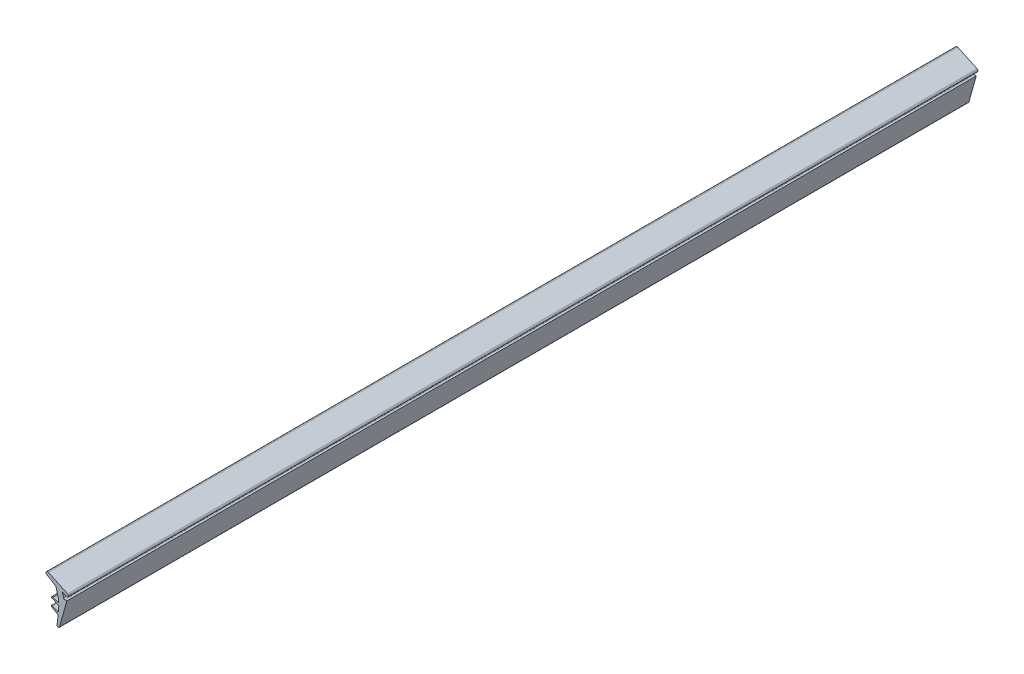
ISO-10303-21;
HEADER;
FILE_DESCRIPTION(('STEP AP214'),'2;1');
FILE_NAME('part.step','',(''),(''),'','','');
FILE_SCHEMA(('AUTOMOTIVE_DESIGN { 1 0 10303 214 1 1 1 1 }'));
ENDSEC;
DATA;
#1=APPLICATION_CONTEXT('core data for automotive mechanical design processes');
#2=APPLICATION_PROTOCOL_DEFINITION('international standard','automotive_design',2000,#1);
#3=PRODUCT_CONTEXT('',#1,'mechanical');
#4=PRODUCT('Part','Part','',(#3));
#5=PRODUCT_RELATED_PRODUCT_CATEGORY('part','',(#4));
#6=PRODUCT_DEFINITION_FORMATION('','',#4);
#7=PRODUCT_DEFINITION_CONTEXT('part definition',#1,'design');
#8=PRODUCT_DEFINITION('design','',#6,#7);
#9=PRODUCT_DEFINITION_SHAPE('','',#8);
#10=(LENGTH_UNIT() NAMED_UNIT(*) SI_UNIT(.MILLI.,.METRE.));
#11=(NAMED_UNIT(*) PLANE_ANGLE_UNIT() SI_UNIT($,.RADIAN.));
#12=(NAMED_UNIT(*) SI_UNIT($,.STERADIAN.) SOLID_ANGLE_UNIT());
#13=UNCERTAINTY_MEASURE_WITH_UNIT(LENGTH_MEASURE(1.E-05),#10,'distance_accuracy_value','');
#14=(GEOMETRIC_REPRESENTATION_CONTEXT(3) GLOBAL_UNCERTAINTY_ASSIGNED_CONTEXT((#13)) GLOBAL_UNIT_ASSIGNED_CONTEXT((#10,
#11,#12)) REPRESENTATION_CONTEXT('',''));
#15=CARTESIAN_POINT('',(0.,0.,0.));
#16=DIRECTION('',(0.,0.,1.));
#17=DIRECTION('',(1.,0.,0.));
#18=AXIS2_PLACEMENT_3D('',#15,#16,#17);
#19=CARTESIAN_POINT('',(0.211137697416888,-1.32671915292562,150.));
#20=DIRECTION('',(0.987572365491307,0.157164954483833,0.));
#21=DIRECTION('',(-0.157164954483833,0.987572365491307,0.));
#22=AXIS2_PLACEMENT_3D('',#19,#20,#21);
#23=PLANE('',#22);
#24=DIRECTION('',(0.157164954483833,-0.987572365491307,0.));
#25=VECTOR('',#24,1.);
#26=CARTESIAN_POINT('',(0.211137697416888,-1.32671915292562,-150.));
#27=LINE('',#26,#25);
#28=CARTESIAN_POINT('',(0.,0.,-150.));
#29=VERTEX_POINT('',#28);
#30=CARTESIAN_POINT('',(0.211137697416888,-1.32671915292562,-150.));
#31=VERTEX_POINT('',#30);
#32=EDGE_CURVE('E222',#29,#31,#27,.T.);
#33=ORIENTED_EDGE('',*,*,#32,.T.);
#34=DIRECTION('',(0.,0.,-1.));
#35=VECTOR('',#34,1.);
#36=CARTESIAN_POINT('',(0.211137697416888,-1.32671915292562,150.));
#37=LINE('',#36,#35);
#38=CARTESIAN_POINT('',(0.211137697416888,-1.32671915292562,150.));
#39=VERTEX_POINT('',#38);
#40=EDGE_CURVE('E203',#39,#31,#37,.T.);
#41=ORIENTED_EDGE('',*,*,#40,.F.);
#42=DIRECTION('',(0.157164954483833,-0.987572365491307,0.));
#43=VECTOR('',#42,1.);
#44=CARTESIAN_POINT('',(0.211137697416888,-1.32671915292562,150.));
#45=LINE('',#44,#43);
#46=CARTESIAN_POINT('',(0.,0.,150.));
#47=VERTEX_POINT('',#46);
#48=EDGE_CURVE('E210',#47,#39,#45,.T.);
#49=ORIENTED_EDGE('',*,*,#48,.F.);
#50=DIRECTION('',(0.,0.,-1.));
#51=VECTOR('',#50,1.);
#52=CARTESIAN_POINT('',(0.,0.,150.));
#53=LINE('',#52,#51);
#54=EDGE_CURVE('E293',#47,#29,#53,.T.);
#55=ORIENTED_EDGE('',*,*,#54,.T.);
#56=EDGE_LOOP('',(#33,#41,#49,#55));
#57=FACE_BOUND('',#56,.T.);
#58=ADVANCED_FACE('F37',(#57),#23,.F.);
#59=CARTESIAN_POINT('',(-1.72845607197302,-0.781621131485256,150.));
#60=DIRECTION('',(-0.270555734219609,-0.962704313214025,0.));
#61=DIRECTION('',(0.962704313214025,-0.270555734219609,0.));
#62=AXIS2_PLACEMENT_3D('',#59,#60,#61);
#63=PLANE('',#62);
#64=DIRECTION('',(-0.962704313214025,0.270555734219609,0.));
#65=VECTOR('',#64,1.);
#66=CARTESIAN_POINT('',(-1.72845607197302,-0.781621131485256,-150.));
#67=LINE('',#66,#65);
#68=CARTESIAN_POINT('',(-1.72845607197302,-0.781621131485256,-150.));
#69=VERTEX_POINT('',#68);
#70=EDGE_CURVE('E302',#31,#69,#67,.T.);
#71=ORIENTED_EDGE('',*,*,#70,.T.);
#72=DIRECTION('',(0.,0.,-1.));
#73=VECTOR('',#72,1.);
#74=CARTESIAN_POINT('',(-1.72845607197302,-0.781621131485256,150.));
#75=LINE('',#74,#73);
#76=CARTESIAN_POINT('',(-1.72845607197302,-0.781621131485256,150.));
#77=VERTEX_POINT('',#76);
#78=EDGE_CURVE('E206',#77,#69,#75,.T.);
#79=ORIENTED_EDGE('',*,*,#78,.F.);
#80=DIRECTION('',(-0.962704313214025,0.270555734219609,0.));
#81=VECTOR('',#80,1.);
#82=CARTESIAN_POINT('',(-1.72845607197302,-0.781621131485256,150.));
#83=LINE('',#82,#81);
#84=EDGE_CURVE('E199',#39,#77,#83,.T.);
#85=ORIENTED_EDGE('',*,*,#84,.F.);
#86=ORIENTED_EDGE('',*,*,#40,.T.);
#87=EDGE_LOOP('',(#71,#79,#85,#86));
#88=FACE_BOUND('',#87,.T.);
#89=ADVANCED_FACE('F201',(#88),#63,.F.);
#90=CARTESIAN_POINT('',(-1.94417640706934,-0.920161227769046,150.));
#91=DIRECTION('',(0.,0.,-1.));
#92=DIRECTION('',(-1.,0.,0.));
#93=AXIS2_PLACEMENT_3D('',#90,#91,#92);
#94=CYLINDRICAL_SURFACE('',#93,0.256375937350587);
#95=CARTESIAN_POINT('',(-1.94417640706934,-0.920161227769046,-150.));
#96=DIRECTION('',(0.,0.,1.));
#97=DIRECTION('',(-1.,0.,0.));
#98=AXIS2_PLACEMENT_3D('',#95,#96,#97);
#99=CIRCLE('',#98,0.256375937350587);
#100=CARTESIAN_POINT('',(-2.05178502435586,-1.15286061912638,-150.));
#101=VERTEX_POINT('',#100);
#102=EDGE_CURVE('E304',#69,#101,#99,.T.);
#103=ORIENTED_EDGE('',*,*,#102,.T.);
#104=DIRECTION('',(0.,0.,-1.));
#105=VECTOR('',#104,1.);
#106=CARTESIAN_POINT('',(-2.05178502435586,-1.15286061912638,150.));
#107=LINE('',#106,#105);
#108=CARTESIAN_POINT('',(-2.05178502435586,-1.15286061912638,150.));
#109=VERTEX_POINT('',#108);
#110=EDGE_CURVE('E227',#109,#101,#107,.T.);
#111=ORIENTED_EDGE('',*,*,#110,.F.);
#112=CARTESIAN_POINT('',(-1.94417640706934,-0.920161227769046,150.));
#113=DIRECTION('',(0.,0.,1.));
#114=DIRECTION('',(-1.,0.,0.));
#115=AXIS2_PLACEMENT_3D('',#112,#113,#114);
#116=CIRCLE('',#115,0.256375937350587);
#117=EDGE_CURVE('E209',#77,#109,#116,.T.);
#118=ORIENTED_EDGE('',*,*,#117,.F.);
#119=ORIENTED_EDGE('',*,*,#78,.T.);
#120=EDGE_LOOP('',(#103,#111,#118,#119));
#121=FACE_BOUND('',#120,.T.);
#122=ADVANCED_FACE('F483',(#121),#94,.T.);
#123=CARTESIAN_POINT('',(0.211137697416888,-2.19931795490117,150.));
#124=DIRECTION('',(0.419729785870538,0.907649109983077,0.));
#125=DIRECTION('',(-0.907649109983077,0.419729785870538,0.));
#126=AXIS2_PLACEMENT_3D('',#123,#124,#125);
#127=PLANE('',#126);
#128=DIRECTION('',(0.907649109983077,-0.419729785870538,0.));
#129=VECTOR('',#128,1.);
#130=CARTESIAN_POINT('',(0.211137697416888,-2.19931795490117,-150.));
#131=LINE('',#130,#129);
#132=CARTESIAN_POINT('',(0.211137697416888,-2.19931795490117,-150.));
#133=VERTEX_POINT('',#132);
#134=EDGE_CURVE('E306',#101,#133,#131,.T.);
#135=ORIENTED_EDGE('',*,*,#134,.T.);
#136=DIRECTION('',(0.,0.,-1.));
#137=VECTOR('',#136,1.);
#138=CARTESIAN_POINT('',(0.211137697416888,-2.19931795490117,150.));
#139=LINE('',#138,#137);
#140=CARTESIAN_POINT('',(0.211137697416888,-2.19931795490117,150.));
#141=VERTEX_POINT('',#140);
#142=EDGE_CURVE('E358',#141,#133,#139,.T.);
#143=ORIENTED_EDGE('',*,*,#142,.F.);
#144=DIRECTION('',(0.907649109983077,-0.419729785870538,0.));
#145=VECTOR('',#144,1.);
#146=CARTESIAN_POINT('',(0.211137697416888,-2.19931795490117,150.));
#147=LINE('',#146,#145);
#148=EDGE_CURVE('E367',#109,#141,#147,.T.);
#149=ORIENTED_EDGE('',*,*,#148,.F.);
#150=ORIENTED_EDGE('',*,*,#110,.T.);
#151=EDGE_LOOP('',(#135,#143,#149,#150));
#152=FACE_BOUND('',#151,.T.);
#153=ADVANCED_FACE('F365',(#152),#127,.F.);
#154=CARTESIAN_POINT('',(0.00638670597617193,-4.16746293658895,150.));
#155=DIRECTION('',(0.994632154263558,-0.103474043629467,0.));
#156=DIRECTION('',(0.103474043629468,0.994632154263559,0.));
#157=AXIS2_PLACEMENT_3D('',#154,#155,#156);
#158=PLANE('',#157);
#159=DIRECTION('',(-0.103474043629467,-0.994632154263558,0.));
#160=VECTOR('',#159,1.);
#161=CARTESIAN_POINT('',(0.00638670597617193,-4.16746293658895,-150.));
#162=LINE('',#161,#160);
#163=CARTESIAN_POINT('',(0.00638670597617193,-4.16746293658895,-150.));
#164=VERTEX_POINT('',#163);
#165=EDGE_CURVE('E308',#133,#164,#162,.T.);
#166=ORIENTED_EDGE('',*,*,#165,.T.);
#167=DIRECTION('',(0.,0.,-1.));
#168=VECTOR('',#167,1.);
#169=CARTESIAN_POINT('',(0.00638670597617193,-4.16746293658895,150.));
#170=LINE('',#169,#168);
#171=CARTESIAN_POINT('',(0.00638670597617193,-4.16746293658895,150.));
#172=VERTEX_POINT('',#171);
#173=EDGE_CURVE('E355',#172,#164,#170,.T.);
#174=ORIENTED_EDGE('',*,*,#173,.F.);
#175=DIRECTION('',(-0.103474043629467,-0.994632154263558,0.));
#176=VECTOR('',#175,1.);
#177=CARTESIAN_POINT('',(0.00638670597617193,-4.16746293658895,150.));
#178=LINE('',#177,#176);
#179=EDGE_CURVE('E384',#141,#172,#178,.T.);
#180=ORIENTED_EDGE('',*,*,#179,.F.);
#181=ORIENTED_EDGE('',*,*,#142,.T.);
#182=EDGE_LOOP('',(#166,#174,#180,#181));
#183=FACE_BOUND('',#182,.T.);
#184=ADVANCED_FACE('F375',(#183),#158,.F.);
#185=CARTESIAN_POINT('',(-1.89761913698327,-3.28698175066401,150.));
#186=DIRECTION('',(-0.419729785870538,-0.907649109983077,0.));
#187=DIRECTION('',(0.907649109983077,-0.419729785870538,0.));
#188=AXIS2_PLACEMENT_3D('',#185,#186,#187);
#189=PLANE('',#188);
#190=DIRECTION('',(-0.907649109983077,0.419729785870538,0.));
#191=VECTOR('',#190,1.);
#192=CARTESIAN_POINT('',(-1.89761913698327,-3.28698175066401,-150.));
#193=LINE('',#192,#191);
#194=CARTESIAN_POINT('',(-1.89761913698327,-3.28698175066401,-150.));
#195=VERTEX_POINT('',#194);
#196=EDGE_CURVE('E310',#164,#195,#193,.T.);
#197=ORIENTED_EDGE('',*,*,#196,.T.);
#198=DIRECTION('',(0.,0.,-1.));
#199=VECTOR('',#198,1.);
#200=CARTESIAN_POINT('',(-1.89761913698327,-3.28698175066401,150.));
#201=LINE('',#200,#199);
#202=CARTESIAN_POINT('',(-1.89761913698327,-3.28698175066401,150.));
#203=VERTEX_POINT('',#202);
#204=EDGE_CURVE('E352',#203,#195,#201,.T.);
#205=ORIENTED_EDGE('',*,*,#204,.F.);
#206=DIRECTION('',(-0.907649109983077,0.419729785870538,0.));
#207=VECTOR('',#206,1.);
#208=CARTESIAN_POINT('',(-1.89761913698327,-3.28698175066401,150.));
#209=LINE('',#208,#207);
#210=EDGE_CURVE('E381',#172,#203,#209,.T.);
#211=ORIENTED_EDGE('',*,*,#210,.F.);
#212=ORIENTED_EDGE('',*,*,#173,.T.);
#213=EDGE_LOOP('',(#197,#205,#211,#212));
#214=FACE_BOUND('',#213,.T.);
#215=ADVANCED_FACE('F379',(#214),#189,.F.);
#216=CARTESIAN_POINT('',(-2.05178502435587,-3.46311537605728,150.));
#217=DIRECTION('',(0.,0.,-1.));
#218=DIRECTION('',(-1.,0.,0.));
#219=AXIS2_PLACEMENT_3D('',#216,#217,#218);
#220=CYLINDRICAL_SURFACE('',#219,0.234073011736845);
#221=CARTESIAN_POINT('',(-2.05178502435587,-3.46311537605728,-150.));
#222=DIRECTION('',(0.,0.,1.));
#223=DIRECTION('',(-1.,0.,0.));
#224=AXIS2_PLACEMENT_3D('',#221,#222,#223);
#225=CIRCLE('',#224,0.234073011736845);
#226=CARTESIAN_POINT('',(-2.1720798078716,-3.66391213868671,-150.));
#227=VERTEX_POINT('',#226);
#228=EDGE_CURVE('E312',#195,#227,#225,.T.);
#229=ORIENTED_EDGE('',*,*,#228,.T.);
#230=DIRECTION('',(0.,0.,-1.));
#231=VECTOR('',#230,1.);
#232=CARTESIAN_POINT('',(-2.1720798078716,-3.66391213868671,150.));
#233=LINE('',#232,#231);
#234=CARTESIAN_POINT('',(-2.1720798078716,-3.66391213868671,150.));
#235=VERTEX_POINT('',#234);
#236=EDGE_CURVE('E349',#235,#227,#233,.T.);
#237=ORIENTED_EDGE('',*,*,#236,.F.);
#238=CARTESIAN_POINT('',(-2.05178502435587,-3.46311537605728,150.));
#239=DIRECTION('',(0.,0.,1.));
#240=DIRECTION('',(-1.,0.,0.));
#241=AXIS2_PLACEMENT_3D('',#238,#239,#240);
#242=CIRCLE('',#241,0.234073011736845);
#243=EDGE_CURVE('E383',#203,#235,#242,.T.);
#244=ORIENTED_EDGE('',*,*,#243,.F.);
#245=ORIENTED_EDGE('',*,*,#204,.T.);
#246=EDGE_LOOP('',(#229,#237,#244,#245));
#247=FACE_BOUND('',#246,.T.);
#248=ADVANCED_FACE('F469',(#247),#220,.T.);
#249=CARTESIAN_POINT('',(0.015216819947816,-4.97429369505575,150.));
#250=DIRECTION('',(0.51391992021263,0.857838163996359,0.));
#251=DIRECTION('',(-0.857838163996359,0.51391992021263,0.));
#252=AXIS2_PLACEMENT_3D('',#249,#250,#251);
#253=PLANE('',#252);
#254=DIRECTION('',(0.857838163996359,-0.51391992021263,0.));
#255=VECTOR('',#254,1.);
#256=CARTESIAN_POINT('',(0.015216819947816,-4.97429369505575,-150.));
#257=LINE('',#256,#255);
#258=CARTESIAN_POINT('',(0.015216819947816,-4.97429369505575,-150.));
#259=VERTEX_POINT('',#258);
#260=EDGE_CURVE('E314',#227,#259,#257,.T.);
#261=ORIENTED_EDGE('',*,*,#260,.T.);
#262=DIRECTION('',(0.,0.,-1.));
#263=VECTOR('',#262,1.);
#264=CARTESIAN_POINT('',(0.015216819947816,-4.97429369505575,150.));
#265=LINE('',#264,#263);
#266=CARTESIAN_POINT('',(0.015216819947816,-4.97429369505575,150.));
#267=VERTEX_POINT('',#266);
#268=EDGE_CURVE('E346',#267,#259,#265,.T.);
#269=ORIENTED_EDGE('',*,*,#268,.F.);
#270=DIRECTION('',(0.857838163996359,-0.51391992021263,0.));
#271=VECTOR('',#270,1.);
#272=CARTESIAN_POINT('',(0.015216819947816,-4.97429369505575,150.));
#273=LINE('',#272,#271);
#274=EDGE_CURVE('E386',#235,#267,#273,.T.);
#275=ORIENTED_EDGE('',*,*,#274,.F.);
#276=ORIENTED_EDGE('',*,*,#236,.T.);
#277=EDGE_LOOP('',(#261,#269,#275,#276));
#278=FACE_BOUND('',#277,.T.);
#279=ADVANCED_FACE('F466',(#278),#253,.F.);
#280=CARTESIAN_POINT('',(-0.380927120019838,-7.94802367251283,150.));
#281=DIRECTION('',(0.991243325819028,-0.132047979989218,0.));
#282=DIRECTION('',(0.132047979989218,0.991243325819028,0.));
#283=AXIS2_PLACEMENT_3D('',#280,#281,#282);
#284=PLANE('',#283);
#285=DIRECTION('',(-0.132047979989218,-0.991243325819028,0.));
#286=VECTOR('',#285,1.);
#287=CARTESIAN_POINT('',(-0.380927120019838,-7.94802367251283,-150.));
#288=LINE('',#287,#286);
#289=CARTESIAN_POINT('',(-0.380927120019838,-7.94802367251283,-150.));
#290=VERTEX_POINT('',#289);
#291=EDGE_CURVE('E316',#259,#290,#288,.T.);
#292=ORIENTED_EDGE('',*,*,#291,.T.);
#293=DIRECTION('',(0.,0.,-1.));
#294=VECTOR('',#293,1.);
#295=CARTESIAN_POINT('',(-0.380927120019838,-7.94802367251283,150.));
#296=LINE('',#295,#294);
#297=CARTESIAN_POINT('',(-0.380927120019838,-7.94802367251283,150.));
#298=VERTEX_POINT('',#297);
#299=EDGE_CURVE('E343',#298,#290,#296,.T.);
#300=ORIENTED_EDGE('',*,*,#299,.F.);
#301=DIRECTION('',(-0.132047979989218,-0.991243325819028,0.));
#302=VECTOR('',#301,1.);
#303=CARTESIAN_POINT('',(-0.380927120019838,-7.94802367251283,150.));
#304=LINE('',#303,#302);
#305=EDGE_CURVE('E392',#267,#298,#304,.T.);
#306=ORIENTED_EDGE('',*,*,#305,.F.);
#307=ORIENTED_EDGE('',*,*,#268,.T.);
#308=EDGE_LOOP('',(#292,#300,#306,#307));
#309=FACE_BOUND('',#308,.T.);
#310=ADVANCED_FACE('F462',(#309),#284,.F.);
#311=CARTESIAN_POINT('',(0.0153325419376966,-8.05938738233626,150.));
#312=DIRECTION('',(0.,0.,-1.));
#313=DIRECTION('',(-1.,0.,0.));
#314=AXIS2_PLACEMENT_3D('',#311,#312,#313);
#315=CYLINDRICAL_SURFACE('',#314,0.411610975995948);
#316=CARTESIAN_POINT('',(0.0153325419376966,-8.05938738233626,-150.));
#317=DIRECTION('',(0.,0.,1.));
#318=DIRECTION('',(-1.,0.,0.));
#319=AXIS2_PLACEMENT_3D('',#316,#317,#318);
#320=CIRCLE('',#319,0.411610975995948);
#321=CARTESIAN_POINT('',(0.411592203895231,-8.1707510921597,-150.));
#322=VERTEX_POINT('',#321);
#323=EDGE_CURVE('E318',#290,#322,#320,.T.);
#324=ORIENTED_EDGE('',*,*,#323,.T.);
#325=DIRECTION('',(0.,0.,-1.));
#326=VECTOR('',#325,1.);
#327=CARTESIAN_POINT('',(0.411592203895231,-8.1707510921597,150.));
#328=LINE('',#327,#326);
#329=CARTESIAN_POINT('',(0.411592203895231,-8.1707510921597,150.));
#330=VERTEX_POINT('',#329);
#331=EDGE_CURVE('E340',#330,#322,#328,.T.);
#332=ORIENTED_EDGE('',*,*,#331,.F.);
#333=CARTESIAN_POINT('',(0.0153325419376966,-8.05938738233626,150.));
#334=DIRECTION('',(0.,0.,1.));
#335=DIRECTION('',(-1.,0.,0.));
#336=AXIS2_PLACEMENT_3D('',#333,#334,#335);
#337=CIRCLE('',#336,0.411610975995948);
#338=EDGE_CURVE('E394',#298,#330,#337,.T.);
#339=ORIENTED_EDGE('',*,*,#338,.F.);
#340=ORIENTED_EDGE('',*,*,#299,.T.);
#341=EDGE_LOOP('',(#324,#332,#339,#340));
#342=FACE_BOUND('',#341,.T.);
#343=ADVANCED_FACE('F458',(#342),#315,.T.);
#344=CARTESIAN_POINT('',(2.84659381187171,0.49358772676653,150.));
#345=DIRECTION('',(-0.962704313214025,0.270555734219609,0.));
#346=DIRECTION('',(-0.270555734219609,-0.962704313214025,0.));
#347=AXIS2_PLACEMENT_3D('',#344,#345,#346);
#348=PLANE('',#347);
#349=DIRECTION('',(0.270555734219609,0.962704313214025,0.));
#350=VECTOR('',#349,1.);
#351=CARTESIAN_POINT('',(2.84659381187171,0.49358772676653,-150.));
#352=LINE('',#351,#350);
#353=CARTESIAN_POINT('',(2.84659381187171,0.49358772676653,-150.));
#354=VERTEX_POINT('',#353);
#355=EDGE_CURVE('E320',#322,#354,#352,.T.);
#356=ORIENTED_EDGE('',*,*,#355,.T.);
#357=DIRECTION('',(0.,0.,-1.));
#358=VECTOR('',#357,1.);
#359=CARTESIAN_POINT('',(2.84659381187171,0.49358772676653,150.));
#360=LINE('',#359,#358);
#361=CARTESIAN_POINT('',(2.84659381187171,0.49358772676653,150.));
#362=VERTEX_POINT('',#361);
#363=EDGE_CURVE('E337',#362,#354,#360,.T.);
#364=ORIENTED_EDGE('',*,*,#363,.F.);
#365=DIRECTION('',(0.270555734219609,0.962704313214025,0.));
#366=VECTOR('',#365,1.);
#367=CARTESIAN_POINT('',(2.84659381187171,0.49358772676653,150.));
#368=LINE('',#367,#366);
#369=EDGE_CURVE('E396',#330,#362,#368,.T.);
#370=ORIENTED_EDGE('',*,*,#369,.F.);
#371=ORIENTED_EDGE('',*,*,#331,.T.);
#372=EDGE_LOOP('',(#356,#364,#370,#371));
#373=FACE_BOUND('',#372,.T.);
#374=ADVANCED_FACE('F452',(#373),#348,.F.);
#375=CARTESIAN_POINT('',(1.84659381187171,0.49358772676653,150.));
#376=DIRECTION('',(0.,-1.,0.));
#377=DIRECTION('',(0.,0.,-1.));
#378=AXIS2_PLACEMENT_3D('',#375,#376,#377);
#379=PLANE('',#378);
#380=DIRECTION('',(-1.,0.,0.));
#381=VECTOR('',#380,1.);
#382=CARTESIAN_POINT('',(1.84659381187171,0.49358772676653,-150.));
#383=LINE('',#382,#381);
#384=CARTESIAN_POINT('',(2.22983834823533,0.49358772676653,-150.));
#385=VERTEX_POINT('',#384);
#386=EDGE_CURVE('E322',#354,#385,#383,.T.);
#387=ORIENTED_EDGE('',*,*,#386,.T.);
#388=DIRECTION('',(0.,0.,-1.));
#389=VECTOR('',#388,1.);
#390=CARTESIAN_POINT('',(2.22983834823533,0.49358772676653,150.));
#391=LINE('',#390,#389);
#392=CARTESIAN_POINT('',(2.22983834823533,0.49358772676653,150.));
#393=VERTEX_POINT('',#392);
#394=EDGE_CURVE('E259',#385,#393,#391,.F.);
#395=ORIENTED_EDGE('',*,*,#394,.T.);
#396=DIRECTION('',(-1.,0.,0.));
#397=VECTOR('',#396,1.);
#398=CARTESIAN_POINT('',(1.84659381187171,0.49358772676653,150.));
#399=LINE('',#398,#397);
#400=EDGE_CURVE('E398',#362,#393,#399,.T.);
#401=ORIENTED_EDGE('',*,*,#400,.F.);
#402=ORIENTED_EDGE('',*,*,#363,.T.);
#403=EDGE_LOOP('',(#387,#395,#401,#402));
#404=FACE_BOUND('',#403,.T.);
#405=ADVANCED_FACE('F446',(#404),#379,.F.);
#406=CARTESIAN_POINT('',(1.3380477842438,2.38352794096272,150.));
#407=DIRECTION('',(-0.965652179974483,-0.259838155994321,0.));
#408=DIRECTION('',(0.259838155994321,-0.965652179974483,0.));
#409=AXIS2_PLACEMENT_3D('',#406,#407,#408);
#410=PLANE('',#409);
#411=DIRECTION('',(-0.259838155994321,0.965652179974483,0.));
#412=VECTOR('',#411,1.);
#413=CARTESIAN_POINT('',(1.3380477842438,2.38352794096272,150.));
#414=LINE('',#413,#412);
#415=CARTESIAN_POINT('',(1.74701225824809,0.86366864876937,150.));
#416=VERTEX_POINT('',#415);
#417=CARTESIAN_POINT('',(1.3380477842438,2.38352794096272,150.));
#418=VERTEX_POINT('',#417);
#419=EDGE_CURVE('E401',#416,#418,#414,.T.);
#420=ORIENTED_EDGE('',*,*,#419,.F.);
#421=DIRECTION('',(0.,0.,-1.));
#422=VECTOR('',#421,1.);
#423=CARTESIAN_POINT('',(1.74701225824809,0.863668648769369,-150.));
#424=LINE('',#423,#422);
#425=CARTESIAN_POINT('',(1.74701225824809,0.86366864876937,-150.));
#426=VERTEX_POINT('',#425);
#427=EDGE_CURVE('E256',#416,#426,#424,.T.);
#428=ORIENTED_EDGE('',*,*,#427,.T.);
#429=DIRECTION('',(-0.259838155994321,0.965652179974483,0.));
#430=VECTOR('',#429,1.);
#431=CARTESIAN_POINT('',(1.3380477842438,2.38352794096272,-150.));
#432=LINE('',#431,#430);
#433=CARTESIAN_POINT('',(1.3380477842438,2.38352794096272,-150.));
#434=VERTEX_POINT('',#433);
#435=EDGE_CURVE('E325',#426,#434,#432,.T.);
#436=ORIENTED_EDGE('',*,*,#435,.T.);
#437=DIRECTION('',(0.,0.,-1.));
#438=VECTOR('',#437,1.);
#439=CARTESIAN_POINT('',(1.3380477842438,2.38352794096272,150.));
#440=LINE('',#439,#438);
#441=EDGE_CURVE('E295',#418,#434,#440,.T.);
#442=ORIENTED_EDGE('',*,*,#441,.F.);
#443=EDGE_LOOP('',(#420,#428,#436,#442));
#444=FACE_BOUND('',#443,.T.);
#445=ADVANCED_FACE('F438',(#444),#410,.F.);
#446=CARTESIAN_POINT('',(3.15334600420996,1.54406836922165,150.));
#447=DIRECTION('',(0.419729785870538,0.907649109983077,0.));
#448=DIRECTION('',(-0.907649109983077,0.419729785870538,0.));
#449=AXIS2_PLACEMENT_3D('',#446,#447,#448);
#450=PLANE('',#449);
#451=DIRECTION('',(0.907649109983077,-0.419729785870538,0.));
#452=VECTOR('',#451,1.);
#453=CARTESIAN_POINT('',(3.15334600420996,1.54406836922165,-150.));
#454=LINE('',#453,#452);
#455=CARTESIAN_POINT('',(2.69952893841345,1.75392979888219,-150.));
#456=VERTEX_POINT('',#455);
#457=EDGE_CURVE('E327',#434,#456,#454,.T.);
#458=ORIENTED_EDGE('',*,*,#457,.T.);
#459=DIRECTION('',(0.,0.,-1.));
#460=VECTOR('',#459,1.);
#461=CARTESIAN_POINT('',(2.69952893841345,1.75392979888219,150.));
#462=LINE('',#461,#460);
#463=CARTESIAN_POINT('',(2.69952893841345,1.75392979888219,150.));
#464=VERTEX_POINT('',#463);
#465=EDGE_CURVE('E52',#456,#464,#462,.F.);
#466=ORIENTED_EDGE('',*,*,#465,.T.);
#467=DIRECTION('',(0.907649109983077,-0.419729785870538,0.));
#468=VECTOR('',#467,1.);
#469=CARTESIAN_POINT('',(3.15334600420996,1.54406836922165,150.));
#470=LINE('',#469,#468);
#471=EDGE_CURVE('E403',#418,#464,#470,.T.);
#472=ORIENTED_EDGE('',*,*,#471,.F.);
#473=ORIENTED_EDGE('',*,*,#441,.T.);
#474=EDGE_LOOP('',(#458,#466,#472,#473));
#475=FACE_BOUND('',#474,.T.);
#476=ADVANCED_FACE('F434',(#475),#450,.F.);
#477=CARTESIAN_POINT('',(-3.69694720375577,5.81047438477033,150.));
#478=DIRECTION('',(-0.419729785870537,-0.907649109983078,0.));
#479=DIRECTION('',(0.907649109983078,-0.419729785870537,0.));
#480=AXIS2_PLACEMENT_3D('',#477,#478,#479);
#481=PLANE('',#480);
#482=DIRECTION('',(-0.907649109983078,0.419729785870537,0.));
#483=VECTOR('',#482,1.);
#484=CARTESIAN_POINT('',(-3.69694720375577,5.81047438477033,150.));
#485=LINE('',#484,#483);
#486=CARTESIAN_POINT('',(3.11804557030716,2.65897516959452,150.));
#487=VERTEX_POINT('',#486);
#488=CARTESIAN_POINT('',(-3.28909384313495,5.62186823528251,150.));
#489=VERTEX_POINT('',#488);
#490=EDGE_CURVE('E405',#487,#489,#485,.T.);
#491=ORIENTED_EDGE('',*,*,#490,.F.);
#492=DIRECTION('',(0.,0.,-1.));
#493=VECTOR('',#492,1.);
#494=CARTESIAN_POINT('',(3.11804557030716,2.65897516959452,150.));
#495=LINE('',#494,#493);
#496=CARTESIAN_POINT('',(3.11804557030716,2.65897516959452,-150.));
#497=VERTEX_POINT('',#496);
#498=EDGE_CURVE('E225',#487,#497,#495,.T.);
#499=ORIENTED_EDGE('',*,*,#498,.T.);
#500=DIRECTION('',(-0.907649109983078,0.419729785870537,0.));
#501=VECTOR('',#500,1.);
#502=CARTESIAN_POINT('',(-3.69694720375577,5.81047438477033,-150.));
#503=LINE('',#502,#501);
#504=CARTESIAN_POINT('',(-3.28909384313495,5.62186823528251,-150.));
#505=VERTEX_POINT('',#504);
#506=EDGE_CURVE('E329',#497,#505,#503,.T.);
#507=ORIENTED_EDGE('',*,*,#506,.T.);
#508=DIRECTION('',(0.,0.,-1.));
#509=VECTOR('',#508,1.);
#510=CARTESIAN_POINT('',(-3.28909384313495,5.62186823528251,150.));
#511=LINE('',#510,#509);
#512=EDGE_CURVE('E223',#505,#489,#511,.F.);
#513=ORIENTED_EDGE('',*,*,#512,.T.);
#514=EDGE_LOOP('',(#491,#499,#507,#513));
#515=FACE_BOUND('',#514,.T.);
#516=ADVANCED_FACE('F424',(#515),#481,.F.);
#517=CARTESIAN_POINT('',(-4.2108671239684,4.95263622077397,150.));
#518=DIRECTION('',(0.857838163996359,-0.51391992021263,0.));
#519=DIRECTION('',(0.51391992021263,0.857838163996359,0.));
#520=AXIS2_PLACEMENT_3D('',#517,#518,#519);
#521=PLANE('',#520);
#522=DIRECTION('',(-0.51391992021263,-0.857838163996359,0.));
#523=VECTOR('',#522,1.);
#524=CARTESIAN_POINT('',(-4.2108671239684,4.95263622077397,-150.));
#525=LINE('',#524,#523);
#526=CARTESIAN_POINT('',(-3.9278778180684,5.42500364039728,-150.));
#527=VERTEX_POINT('',#526);
#528=CARTESIAN_POINT('',(-3.95390716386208,5.38155530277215,-150.));
#529=VERTEX_POINT('',#528);
#530=EDGE_CURVE('E286',#527,#529,#525,.T.);
#531=ORIENTED_EDGE('',*,*,#530,.T.);
#532=DIRECTION('',(0.,0.,-1.));
#533=VECTOR('',#532,1.);
#534=CARTESIAN_POINT('',(-3.95390716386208,5.38155530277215,150.));
#535=LINE('',#534,#533);
#536=CARTESIAN_POINT('',(-3.95390716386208,5.38155530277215,150.));
#537=VERTEX_POINT('',#536);
#538=EDGE_CURVE('E254',#529,#537,#535,.F.);
#539=ORIENTED_EDGE('',*,*,#538,.T.);
#540=DIRECTION('',(-0.51391992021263,-0.857838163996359,0.));
#541=VECTOR('',#540,1.);
#542=CARTESIAN_POINT('',(-4.2108671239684,4.95263622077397,150.));
#543=LINE('',#542,#541);
#544=CARTESIAN_POINT('',(-3.9278778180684,5.42500364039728,150.));
#545=VERTEX_POINT('',#544);
#546=EDGE_CURVE('E297',#545,#537,#543,.T.);
#547=ORIENTED_EDGE('',*,*,#546,.F.);
#548=DIRECTION('',(0.,0.,-1.));
#549=VECTOR('',#548,1.);
#550=CARTESIAN_POINT('',(-3.9278778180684,5.42500364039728,150.));
#551=LINE('',#550,#549);
#552=EDGE_CURVE('E251',#545,#527,#551,.T.);
#553=ORIENTED_EDGE('',*,*,#552,.T.);
#554=EDGE_LOOP('',(#531,#539,#547,#553));
#555=FACE_BOUND('',#554,.T.);
#556=ADVANCED_FACE('F417',(#555),#521,.F.);
#557=CARTESIAN_POINT('',(-0.779514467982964,2.89695653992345,150.));
#558=DIRECTION('',(0.51391992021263,0.857838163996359,0.));
#559=DIRECTION('',(-0.857838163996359,0.51391992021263,0.));
#560=AXIS2_PLACEMENT_3D('',#557,#558,#559);
#561=PLANE('',#560);
#562=DIRECTION('',(0.857838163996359,-0.51391992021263,0.));
#563=VECTOR('',#562,1.);
#564=CARTESIAN_POINT('',(-0.779514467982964,2.89695653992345,-150.));
#565=LINE('',#564,#563);
#566=CARTESIAN_POINT('',(-3.78194804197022,4.69567626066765,-150.));
#567=VERTEX_POINT('',#566);
#568=CARTESIAN_POINT('',(-0.952871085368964,3.00081228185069,-150.));
#569=VERTEX_POINT('',#568);
#570=EDGE_CURVE('E277',#567,#569,#565,.T.);
#571=ORIENTED_EDGE('',*,*,#570,.T.);
#572=DIRECTION('',(0.,0.,-1.));
#573=VECTOR('',#572,1.);
#574=CARTESIAN_POINT('',(-0.952871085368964,3.00081228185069,150.));
#575=LINE('',#574,#573);
#576=CARTESIAN_POINT('',(-0.952871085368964,3.00081228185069,150.));
#577=VERTEX_POINT('',#576);
#578=EDGE_CURVE('E264',#569,#577,#575,.F.);
#579=ORIENTED_EDGE('',*,*,#578,.T.);
#580=DIRECTION('',(0.857838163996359,-0.51391992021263,0.));
#581=VECTOR('',#580,1.);
#582=CARTESIAN_POINT('',(-0.779514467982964,2.89695653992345,150.));
#583=LINE('',#582,#581);
#584=CARTESIAN_POINT('',(-3.78194804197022,4.69567626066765,150.));
#585=VERTEX_POINT('',#584);
#586=EDGE_CURVE('E290',#585,#577,#583,.T.);
#587=ORIENTED_EDGE('',*,*,#586,.F.);
#588=DIRECTION('',(0.,0.,-1.));
#589=VECTOR('',#588,1.);
#590=CARTESIAN_POINT('',(-3.78194804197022,4.69567626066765,150.));
#591=LINE('',#590,#589);
#592=EDGE_CURVE('E248',#585,#567,#591,.T.);
#593=ORIENTED_EDGE('',*,*,#592,.T.);
#594=EDGE_LOOP('',(#571,#579,#587,#593));
#595=FACE_BOUND('',#594,.T.);
#596=ADVANCED_FACE('F282',(#595),#561,.F.);
#597=CARTESIAN_POINT('',(0.,0.,150.));
#598=DIRECTION('',(0.965652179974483,0.259838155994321,0.));
#599=DIRECTION('',(-0.259838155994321,0.965652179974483,0.));
#600=AXIS2_PLACEMENT_3D('',#597,#598,#599);
#601=PLANE('',#600);
#602=DIRECTION('',(0.259838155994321,-0.965652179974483,0.));
#603=VECTOR('',#602,1.);
#604=CARTESIAN_POINT('',(0.,0.,150.));
#605=LINE('',#604,#603);
#606=CARTESIAN_POINT('',(-0.727004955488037,2.70181227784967,150.));
#607=VERTEX_POINT('',#606);
#608=EDGE_CURVE('E215',#607,#47,#605,.T.);
#609=ORIENTED_EDGE('',*,*,#608,.F.);
#610=DIRECTION('',(0.,0.,-1.));
#611=VECTOR('',#610,1.);
#612=CARTESIAN_POINT('',(-0.727004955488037,2.70181227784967,-150.));
#613=LINE('',#612,#611);
#614=CARTESIAN_POINT('',(-0.727004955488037,2.70181227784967,-150.));
#615=VERTEX_POINT('',#614);
#616=EDGE_CURVE('E261',#607,#615,#613,.T.);
#617=ORIENTED_EDGE('',*,*,#616,.T.);
#618=DIRECTION('',(0.259838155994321,-0.965652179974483,0.));
#619=VECTOR('',#618,1.);
#620=CARTESIAN_POINT('',(0.,0.,-150.));
#621=LINE('',#620,#619);
#622=EDGE_CURVE('E219',#615,#29,#621,.T.);
#623=ORIENTED_EDGE('',*,*,#622,.T.);
#624=ORIENTED_EDGE('',*,*,#54,.F.);
#625=EDGE_LOOP('',(#609,#617,#623,#624));
#626=FACE_BOUND('',#625,.T.);
#627=ADVANCED_FACE('F292',(#626),#601,.F.);
#628=CARTESIAN_POINT('',(0.0153325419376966,-8.05938738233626,150.));
#629=DIRECTION('',(0.,0.,-1.));
#630=DIRECTION('',(-1.,0.,0.));
#631=AXIS2_PLACEMENT_3D('',#628,#629,#630);
#632=PLANE('',#631);
#633=ORIENTED_EDGE('',*,*,#471,.T.);
#634=CARTESIAN_POINT('',(2.90939383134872,2.20775435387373,150.));
#635=DIRECTION('',(0.,0.,-1.));
#636=DIRECTION('',(-1.,0.,0.));
#637=AXIS2_PLACEMENT_3D('',#634,#635,#636);
#638=CIRCLE('',#637,0.5);
#639=CARTESIAN_POINT('',(3.36200523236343,1.99528572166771,150.));
#640=VERTEX_POINT('',#639);
#641=EDGE_CURVE('E268',#464,#640,#638,.F.);
#642=ORIENTED_EDGE('',*,*,#641,.T.);
#643=CARTESIAN_POINT('',(2.90818067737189,2.20515061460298,150.));
#644=DIRECTION('',(0.,0.,-1.));
#645=DIRECTION('',(-1.,0.,0.));
#646=AXIS2_PLACEMENT_3D('',#643,#644,#645);
#647=CIRCLE('',#646,0.5);
#648=EDGE_CURVE('E246',#640,#487,#647,.F.);
#649=ORIENTED_EDGE('',*,*,#648,.T.);
#650=ORIENTED_EDGE('',*,*,#490,.T.);
#651=CARTESIAN_POINT('',(-3.49895873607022,5.16804368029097,150.));
#652=DIRECTION('',(0.,0.,-1.));
#653=DIRECTION('',(-1.,0.,0.));
#654=AXIS2_PLACEMENT_3D('',#651,#652,#653);
#655=CIRCLE('',#654,0.5);
#656=EDGE_CURVE('E242',#489,#545,#655,.F.);
#657=ORIENTED_EDGE('',*,*,#656,.T.);
#658=ORIENTED_EDGE('',*,*,#546,.T.);
#659=CARTESIAN_POINT('',(-3.5249880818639,5.12459534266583,150.));
#660=DIRECTION('',(0.,0.,-1.));
#661=DIRECTION('',(-1.,0.,0.));
#662=AXIS2_PLACEMENT_3D('',#659,#660,#661);
#663=CIRCLE('',#662,0.5);
#664=EDGE_CURVE('E244',#537,#585,#663,.F.);
#665=ORIENTED_EDGE('',*,*,#664,.T.);
#666=ORIENTED_EDGE('',*,*,#586,.T.);
#667=CARTESIAN_POINT('',(-1.20983104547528,2.57189319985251,150.));
#668=DIRECTION('',(0.,0.,-1.));
#669=DIRECTION('',(-1.,0.,0.));
#670=AXIS2_PLACEMENT_3D('',#667,#668,#669);
#671=CIRCLE('',#670,0.5);
#672=EDGE_CURVE('E11',#577,#607,#671,.T.);
#673=ORIENTED_EDGE('',*,*,#672,.T.);
#674=ORIENTED_EDGE('',*,*,#608,.T.);
#675=ORIENTED_EDGE('',*,*,#48,.T.);
#676=ORIENTED_EDGE('',*,*,#84,.T.);
#677=ORIENTED_EDGE('',*,*,#117,.T.);
#678=ORIENTED_EDGE('',*,*,#148,.T.);
#679=ORIENTED_EDGE('',*,*,#179,.T.);
#680=ORIENTED_EDGE('',*,*,#210,.T.);
#681=ORIENTED_EDGE('',*,*,#243,.T.);
#682=ORIENTED_EDGE('',*,*,#274,.T.);
#683=ORIENTED_EDGE('',*,*,#305,.T.);
#684=ORIENTED_EDGE('',*,*,#338,.T.);
#685=ORIENTED_EDGE('',*,*,#369,.T.);
#686=ORIENTED_EDGE('',*,*,#400,.T.);
#687=CARTESIAN_POINT('',(2.22983834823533,0.99358772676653,150.));
#688=DIRECTION('',(0.,0.,-1.));
#689=DIRECTION('',(-1.,0.,0.));
#690=AXIS2_PLACEMENT_3D('',#687,#688,#689);
#691=CIRCLE('',#690,0.5);
#692=EDGE_CURVE('E272',#393,#416,#691,.T.);
#693=ORIENTED_EDGE('',*,*,#692,.T.);
#694=ORIENTED_EDGE('',*,*,#419,.T.);
#695=EDGE_LOOP('',(#633,#642,#649,#650,#657,#658,#665,#666,#673,#674,#675,#676,#677,#678,#679,
#680,#681,#682,#683,#684,#685,#686,#693,#694));
#696=FACE_BOUND('',#695,.T.);
#697=ADVANCED_FACE('F213',(#696),#632,.F.);
#698=CARTESIAN_POINT('',(0.0153325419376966,-8.05938738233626,-150.));
#699=DIRECTION('',(0.,0.,-1.));
#700=DIRECTION('',(-1.,0.,0.));
#701=AXIS2_PLACEMENT_3D('',#698,#699,#700);
#702=PLANE('',#701);
#703=CARTESIAN_POINT('',(2.90818067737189,2.20515061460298,-150.));
#704=DIRECTION('',(0.,0.,-1.));
#705=DIRECTION('',(-1.,0.,0.));
#706=AXIS2_PLACEMENT_3D('',#703,#704,#705);
#707=CIRCLE('',#706,0.5);
#708=CARTESIAN_POINT('',(3.36200523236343,1.99528572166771,-150.));
#709=VERTEX_POINT('',#708);
#710=EDGE_CURVE('E237',#497,#709,#707,.T.);
#711=ORIENTED_EDGE('',*,*,#710,.T.);
#712=CARTESIAN_POINT('',(2.90939383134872,2.20775435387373,-150.));
#713=DIRECTION('',(0.,0.,-1.));
#714=DIRECTION('',(-1.,0.,0.));
#715=AXIS2_PLACEMENT_3D('',#712,#713,#714);
#716=CIRCLE('',#715,0.5);
#717=EDGE_CURVE('E60',#709,#456,#716,.T.);
#718=ORIENTED_EDGE('',*,*,#717,.T.);
#719=ORIENTED_EDGE('',*,*,#457,.F.);
#720=ORIENTED_EDGE('',*,*,#435,.F.);
#721=CARTESIAN_POINT('',(2.22983834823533,0.99358772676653,-150.));
#722=DIRECTION('',(0.,0.,-1.));
#723=DIRECTION('',(-1.,0.,0.));
#724=AXIS2_PLACEMENT_3D('',#721,#722,#723);
#725=CIRCLE('',#724,0.5);
#726=EDGE_CURVE('E270',#426,#385,#725,.F.);
#727=ORIENTED_EDGE('',*,*,#726,.T.);
#728=ORIENTED_EDGE('',*,*,#386,.F.);
#729=ORIENTED_EDGE('',*,*,#355,.F.);
#730=ORIENTED_EDGE('',*,*,#323,.F.);
#731=ORIENTED_EDGE('',*,*,#291,.F.);
#732=ORIENTED_EDGE('',*,*,#260,.F.);
#733=ORIENTED_EDGE('',*,*,#228,.F.);
#734=ORIENTED_EDGE('',*,*,#196,.F.);
#735=ORIENTED_EDGE('',*,*,#165,.F.);
#736=ORIENTED_EDGE('',*,*,#134,.F.);
#737=ORIENTED_EDGE('',*,*,#102,.F.);
#738=ORIENTED_EDGE('',*,*,#70,.F.);
#739=ORIENTED_EDGE('',*,*,#32,.F.);
#740=ORIENTED_EDGE('',*,*,#622,.F.);
#741=CARTESIAN_POINT('',(-1.20983104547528,2.57189319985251,-150.));
#742=DIRECTION('',(0.,0.,-1.));
#743=DIRECTION('',(-1.,0.,0.));
#744=AXIS2_PLACEMENT_3D('',#741,#742,#743);
#745=CIRCLE('',#744,0.5);
#746=EDGE_CURVE('E45',#615,#569,#745,.F.);
#747=ORIENTED_EDGE('',*,*,#746,.T.);
#748=ORIENTED_EDGE('',*,*,#570,.F.);
#749=CARTESIAN_POINT('',(-3.5249880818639,5.12459534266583,-150.));
#750=DIRECTION('',(0.,0.,-1.));
#751=DIRECTION('',(-1.,0.,0.));
#752=AXIS2_PLACEMENT_3D('',#749,#750,#751);
#753=CIRCLE('',#752,0.5);
#754=EDGE_CURVE('E235',#567,#529,#753,.T.);
#755=ORIENTED_EDGE('',*,*,#754,.T.);
#756=ORIENTED_EDGE('',*,*,#530,.F.);
#757=CARTESIAN_POINT('',(-3.49895873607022,5.16804368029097,-150.));
#758=DIRECTION('',(0.,0.,-1.));
#759=DIRECTION('',(-1.,0.,0.));
#760=AXIS2_PLACEMENT_3D('',#757,#758,#759);
#761=CIRCLE('',#760,0.5);
#762=EDGE_CURVE('E233',#527,#505,#761,.T.);
#763=ORIENTED_EDGE('',*,*,#762,.T.);
#764=ORIENTED_EDGE('',*,*,#506,.F.);
#765=EDGE_LOOP('',(#711,#718,#719,#720,#727,#728,#729,#730,#731,#732,#733,#734,#735,#736,#737,
#738,#739,#740,#747,#748,#755,#756,#763,#764));
#766=FACE_BOUND('',#765,.T.);
#767=ADVANCED_FACE('F276',(#766),#702,.T.);
#768=CARTESIAN_POINT('',(2.90818067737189,2.20515061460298,150.));
#769=DIRECTION('',(0.,0.,-1.));
#770=DIRECTION('',(-1.,0.,0.));
#771=AXIS2_PLACEMENT_3D('',#768,#769,#770);
#772=CYLINDRICAL_SURFACE('',#771,0.5);
#773=ORIENTED_EDGE('',*,*,#648,.F.);
#774=DIRECTION('',(0.,0.,-1.));
#775=VECTOR('',#774,1.);
#776=CARTESIAN_POINT('',(3.36200523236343,1.99528572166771,150.));
#777=LINE('',#776,#775);
#778=EDGE_CURVE('E239',#709,#640,#777,.F.);
#779=ORIENTED_EDGE('',*,*,#778,.F.);
#780=ORIENTED_EDGE('',*,*,#710,.F.);
#781=ORIENTED_EDGE('',*,*,#498,.F.);
#782=EDGE_LOOP('',(#773,#779,#780,#781));
#783=FACE_BOUND('',#782,.T.);
#784=ADVANCED_FACE('F428',(#783),#772,.T.);
#785=CARTESIAN_POINT('',(-3.5249880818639,5.12459534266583,150.));
#786=DIRECTION('',(0.,0.,-1.));
#787=DIRECTION('',(-1.,0.,0.));
#788=AXIS2_PLACEMENT_3D('',#785,#786,#787);
#789=CYLINDRICAL_SURFACE('',#788,0.5);
#790=ORIENTED_EDGE('',*,*,#664,.F.);
#791=ORIENTED_EDGE('',*,*,#538,.F.);
#792=ORIENTED_EDGE('',*,*,#754,.F.);
#793=ORIENTED_EDGE('',*,*,#592,.F.);
#794=EDGE_LOOP('',(#790,#791,#792,#793));
#795=FACE_BOUND('',#794,.T.);
#796=ADVANCED_FACE('F415',(#795),#789,.T.);
#797=CARTESIAN_POINT('',(-3.49895873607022,5.16804368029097,150.));
#798=DIRECTION('',(0.,0.,-1.));
#799=DIRECTION('',(-1.,0.,0.));
#800=AXIS2_PLACEMENT_3D('',#797,#798,#799);
#801=CYLINDRICAL_SURFACE('',#800,0.5);
#802=ORIENTED_EDGE('',*,*,#656,.F.);
#803=ORIENTED_EDGE('',*,*,#512,.F.);
#804=ORIENTED_EDGE('',*,*,#762,.F.);
#805=ORIENTED_EDGE('',*,*,#552,.F.);
#806=EDGE_LOOP('',(#802,#803,#804,#805));
#807=FACE_BOUND('',#806,.T.);
#808=ADVANCED_FACE('F419',(#807),#801,.T.);
#809=CARTESIAN_POINT('',(2.22983834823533,0.99358772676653,150.));
#810=DIRECTION('',(0.,0.,1.));
#811=DIRECTION('',(1.,0.,0.));
#812=AXIS2_PLACEMENT_3D('',#809,#810,#811);
#813=CYLINDRICAL_SURFACE('',#812,0.5);
#814=ORIENTED_EDGE('',*,*,#692,.F.);
#815=ORIENTED_EDGE('',*,*,#394,.F.);
#816=ORIENTED_EDGE('',*,*,#726,.F.);
#817=ORIENTED_EDGE('',*,*,#427,.F.);
#818=EDGE_LOOP('',(#814,#815,#816,#817));
#819=FACE_BOUND('',#818,.T.);
#820=ADVANCED_FACE('F442',(#819),#813,.F.);
#821=CARTESIAN_POINT('',(-1.20983104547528,2.57189319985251,150.));
#822=DIRECTION('',(0.,0.,1.));
#823=DIRECTION('',(1.,0.,0.));
#824=AXIS2_PLACEMENT_3D('',#821,#822,#823);
#825=CYLINDRICAL_SURFACE('',#824,0.5);
#826=ORIENTED_EDGE('',*,*,#672,.F.);
#827=ORIENTED_EDGE('',*,*,#578,.F.);
#828=ORIENTED_EDGE('',*,*,#746,.F.);
#829=ORIENTED_EDGE('',*,*,#616,.F.);
#830=EDGE_LOOP('',(#826,#827,#828,#829));
#831=FACE_BOUND('',#830,.T.);
#832=ADVANCED_FACE('F289',(#831),#825,.F.);
#833=CARTESIAN_POINT('',(2.90939383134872,2.20775435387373,150.));
#834=DIRECTION('',(0.,0.,-1.));
#835=DIRECTION('',(-1.,0.,0.));
#836=AXIS2_PLACEMENT_3D('',#833,#834,#835);
#837=CYLINDRICAL_SURFACE('',#836,0.5);
#838=ORIENTED_EDGE('',*,*,#641,.F.);
#839=ORIENTED_EDGE('',*,*,#465,.F.);
#840=ORIENTED_EDGE('',*,*,#717,.F.);
#841=ORIENTED_EDGE('',*,*,#778,.T.);
#842=EDGE_LOOP('',(#838,#839,#840,#841));
#843=FACE_BOUND('',#842,.T.);
#844=ADVANCED_FACE('F39',(#843),#837,.T.);
#845=CLOSED_SHELL('',(#58,#89,#122,#153,#184,#215,#248,#279,#310,#343,#374,#405,#445,#476,#516,
#556,#596,#627,#697,#767,#784,#796,#808,#820,#832,#844));
#846=MANIFOLD_SOLID_BREP('B2',#845);
#847=ADVANCED_BREP_SHAPE_REPRESENTATION('',(#18,#846),#14);
#848=SHAPE_DEFINITION_REPRESENTATION(#9,#847);
ENDSEC;
END-ISO-10303-21;
